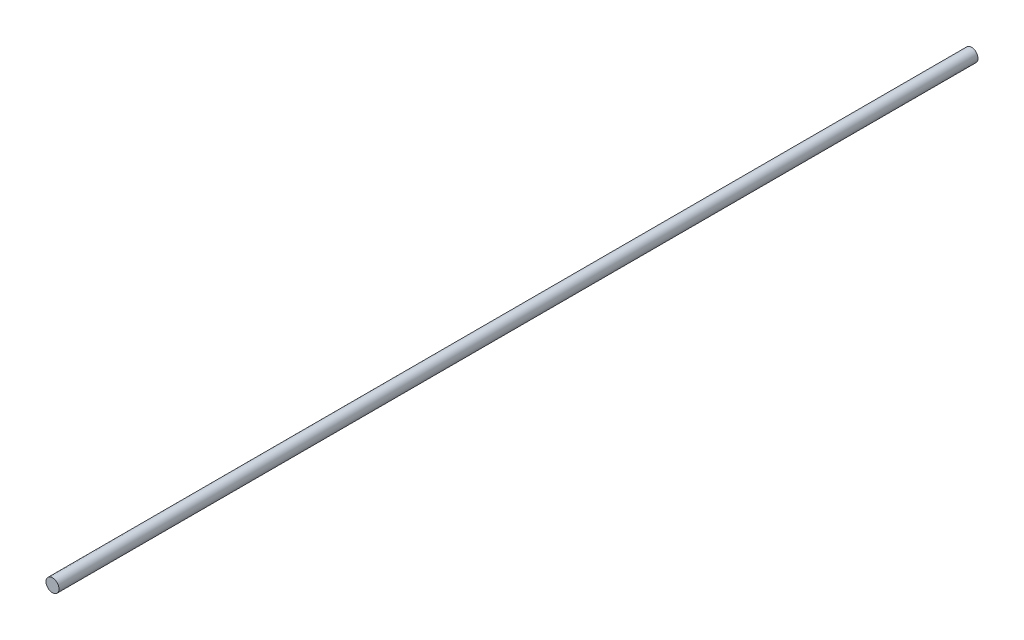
ISO-10303-21;
HEADER;
FILE_DESCRIPTION(('STEP AP214'),'2;1');
FILE_NAME('part.step','',(''),(''),'','','');
FILE_SCHEMA(('AUTOMOTIVE_DESIGN { 1 0 10303 214 1 1 1 1 }'));
ENDSEC;
DATA;
#1=APPLICATION_CONTEXT('core data for automotive mechanical design processes');
#2=APPLICATION_PROTOCOL_DEFINITION('international standard','automotive_design',2000,#1);
#3=PRODUCT_CONTEXT('',#1,'mechanical');
#4=PRODUCT('Part','Part','',(#3));
#5=PRODUCT_RELATED_PRODUCT_CATEGORY('part','',(#4));
#6=PRODUCT_DEFINITION_FORMATION('','',#4);
#7=PRODUCT_DEFINITION_CONTEXT('part definition',#1,'design');
#8=PRODUCT_DEFINITION('design','',#6,#7);
#9=PRODUCT_DEFINITION_SHAPE('','',#8);
#10=(LENGTH_UNIT() NAMED_UNIT(*) SI_UNIT(.MILLI.,.METRE.));
#11=(NAMED_UNIT(*) PLANE_ANGLE_UNIT() SI_UNIT($,.RADIAN.));
#12=(NAMED_UNIT(*) SI_UNIT($,.STERADIAN.) SOLID_ANGLE_UNIT());
#13=UNCERTAINTY_MEASURE_WITH_UNIT(LENGTH_MEASURE(1.E-05),#10,'distance_accuracy_value','');
#14=(GEOMETRIC_REPRESENTATION_CONTEXT(3) GLOBAL_UNCERTAINTY_ASSIGNED_CONTEXT((#13)) GLOBAL_UNIT_ASSIGNED_CONTEXT((#10,
#11,#12)) REPRESENTATION_CONTEXT('',''));
#15=CARTESIAN_POINT('',(0.,0.,0.));
#16=DIRECTION('',(0.,0.,1.));
#17=DIRECTION('',(1.,0.,0.));
#18=AXIS2_PLACEMENT_3D('',#15,#16,#17);
#19=CARTESIAN_POINT('',(0.,0.,-4250.));
#20=DIRECTION('',(0.,0.,1.));
#21=DIRECTION('',(1.,0.,0.));
#22=AXIS2_PLACEMENT_3D('',#19,#20,#21);
#23=CYLINDRICAL_SURFACE('',#22,30.);
#24=CARTESIAN_POINT('',(0.,0.,-4250.));
#25=DIRECTION('',(0.,0.,1.));
#26=DIRECTION('',(1.,0.,0.));
#27=AXIS2_PLACEMENT_3D('',#24,#25,#26);
#28=CIRCLE('',#27,30.);
#29=CARTESIAN_POINT('',(30.,0.,-4250.));
#30=VERTEX_POINT('',#29);
#31=EDGE_CURVE('E10',#30,#30,#28,.T.);
#32=ORIENTED_EDGE('',*,*,#31,.T.);
#33=EDGE_LOOP('',(#32));
#34=FACE_BOUND('',#33,.T.);
#35=CARTESIAN_POINT('',(0.,0.,0.));
#36=DIRECTION('',(0.,0.,1.));
#37=DIRECTION('',(1.,0.,0.));
#38=AXIS2_PLACEMENT_3D('',#35,#36,#37);
#39=CIRCLE('',#38,30.);
#40=CARTESIAN_POINT('',(30.,0.,0.));
#41=VERTEX_POINT('',#40);
#42=EDGE_CURVE('E40',#41,#41,#39,.T.);
#43=ORIENTED_EDGE('',*,*,#42,.F.);
#44=EDGE_LOOP('',(#43));
#45=FACE_BOUND('',#44,.T.);
#46=ADVANCED_FACE('F37',(#34,#45),#23,.T.);
#47=CARTESIAN_POINT('',(0.,0.,-4250.));
#48=DIRECTION('',(0.,0.,1.));
#49=DIRECTION('',(1.,0.,0.));
#50=AXIS2_PLACEMENT_3D('',#47,#48,#49);
#51=PLANE('',#50);
#52=ORIENTED_EDGE('',*,*,#31,.F.);
#53=EDGE_LOOP('',(#52));
#54=FACE_BOUND('',#53,.T.);
#55=ADVANCED_FACE('F54',(#54),#51,.F.);
#56=CARTESIAN_POINT('',(0.,0.,0.));
#57=DIRECTION('',(0.,0.,1.));
#58=DIRECTION('',(1.,0.,0.));
#59=AXIS2_PLACEMENT_3D('',#56,#57,#58);
#60=PLANE('',#59);
#61=ORIENTED_EDGE('',*,*,#42,.T.);
#62=EDGE_LOOP('',(#61));
#63=FACE_BOUND('',#62,.T.);
#64=ADVANCED_FACE('F51',(#63),#60,.T.);
#65=CLOSED_SHELL('',(#46,#55,#64));
#66=MANIFOLD_SOLID_BREP('B2',#65);
#67=ADVANCED_BREP_SHAPE_REPRESENTATION('',(#18,#66),#14);
#68=SHAPE_DEFINITION_REPRESENTATION(#9,#67);
ENDSEC;
END-ISO-10303-21;
